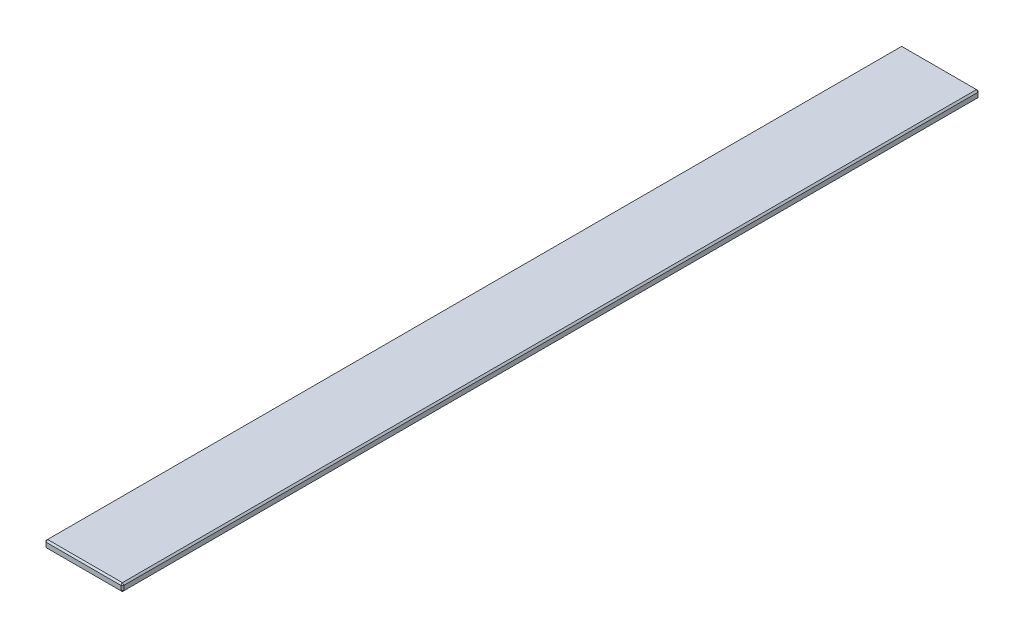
ISO-10303-21;
HEADER;
FILE_DESCRIPTION(('STEP AP214'),'2;1');
FILE_NAME('part.step','',(''),(''),'','','');
FILE_SCHEMA(('AUTOMOTIVE_DESIGN { 1 0 10303 214 1 1 1 1 }'));
ENDSEC;
DATA;
#1=APPLICATION_CONTEXT('core data for automotive mechanical design processes');
#2=APPLICATION_PROTOCOL_DEFINITION('international standard','automotive_design',2000,#1);
#3=PRODUCT_CONTEXT('',#1,'mechanical');
#4=PRODUCT('Part','Part','',(#3));
#5=PRODUCT_RELATED_PRODUCT_CATEGORY('part','',(#4));
#6=PRODUCT_DEFINITION_FORMATION('','',#4);
#7=PRODUCT_DEFINITION_CONTEXT('part definition',#1,'design');
#8=PRODUCT_DEFINITION('design','',#6,#7);
#9=PRODUCT_DEFINITION_SHAPE('','',#8);
#10=(LENGTH_UNIT() NAMED_UNIT(*) SI_UNIT(.MILLI.,.METRE.));
#11=(NAMED_UNIT(*) PLANE_ANGLE_UNIT() SI_UNIT($,.RADIAN.));
#12=(NAMED_UNIT(*) SI_UNIT($,.STERADIAN.) SOLID_ANGLE_UNIT());
#13=UNCERTAINTY_MEASURE_WITH_UNIT(LENGTH_MEASURE(1.E-05),#10,'distance_accuracy_value','');
#14=(GEOMETRIC_REPRESENTATION_CONTEXT(3) GLOBAL_UNCERTAINTY_ASSIGNED_CONTEXT((#13)) GLOBAL_UNIT_ASSIGNED_CONTEXT((#10,
#11,#12)) REPRESENTATION_CONTEXT('',''));
#15=CARTESIAN_POINT('',(0.,0.,0.));
#16=DIRECTION('',(0.,0.,1.));
#17=DIRECTION('',(1.,0.,0.));
#18=AXIS2_PLACEMENT_3D('',#15,#16,#17);
#19=CARTESIAN_POINT('',(50.,-4.99999999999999,550.));
#20=DIRECTION('',(-1.,0.,0.));
#21=DIRECTION('',(0.,0.,1.));
#22=AXIS2_PLACEMENT_3D('',#19,#20,#21);
#23=PLANE('',#22);
#24=DIRECTION('',(0.,0.,-1.));
#25=VECTOR('',#24,1.);
#26=CARTESIAN_POINT('',(50.,-2.99999999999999,550.));
#27=LINE('',#26,#25);
#28=CARTESIAN_POINT('',(50.,-2.99999999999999,548.));
#29=VERTEX_POINT('',#28);
#30=CARTESIAN_POINT('',(50.,-2.99999999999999,-548.));
#31=VERTEX_POINT('',#30);
#32=EDGE_CURVE('E173',#29,#31,#27,.T.);
#33=ORIENTED_EDGE('',*,*,#32,.T.);
#34=DIRECTION('',(0.,1.,0.));
#35=VECTOR('',#34,1.);
#36=CARTESIAN_POINT('',(50.,-4.99999999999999,-548.));
#37=LINE('',#36,#35);
#38=CARTESIAN_POINT('',(50.,2.9999999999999,-548.));
#39=VERTEX_POINT('',#38);
#40=EDGE_CURVE('E175',#31,#39,#37,.T.);
#41=ORIENTED_EDGE('',*,*,#40,.T.);
#42=DIRECTION('',(0.,0.,1.));
#43=VECTOR('',#42,1.);
#44=CARTESIAN_POINT('',(50.,2.9999999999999,550.));
#45=LINE('',#44,#43);
#46=CARTESIAN_POINT('',(50.,2.9999999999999,548.));
#47=VERTEX_POINT('',#46);
#48=EDGE_CURVE('E169',#39,#47,#45,.T.);
#49=ORIENTED_EDGE('',*,*,#48,.T.);
#50=DIRECTION('',(0.,-1.,0.));
#51=VECTOR('',#50,1.);
#52=CARTESIAN_POINT('',(50.,-4.99999999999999,548.));
#53=LINE('',#52,#51);
#54=EDGE_CURVE('E171',#47,#29,#53,.T.);
#55=ORIENTED_EDGE('',*,*,#54,.T.);
#56=EDGE_LOOP('',(#33,#41,#49,#55));
#57=FACE_BOUND('',#56,.T.);
#58=ADVANCED_FACE('F30',(#57),#23,.F.);
#59=CARTESIAN_POINT('',(50.,5.00000000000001,550.));
#60=DIRECTION('',(0.,-1.,0.));
#61=DIRECTION('',(1.,0.,0.));
#62=AXIS2_PLACEMENT_3D('',#59,#60,#61);
#63=PLANE('',#62);
#64=DIRECTION('',(1.,0.,0.));
#65=VECTOR('',#64,1.);
#66=CARTESIAN_POINT('',(50.,5.00000000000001,548.));
#67=LINE('',#66,#65);
#68=CARTESIAN_POINT('',(-48.,4.99999999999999,548.));
#69=VERTEX_POINT('',#68);
#70=CARTESIAN_POINT('',(48.,5.00000000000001,548.));
#71=VERTEX_POINT('',#70);
#72=EDGE_CURVE('E39',#69,#71,#67,.T.);
#73=ORIENTED_EDGE('',*,*,#72,.T.);
#74=DIRECTION('',(0.,0.,-1.));
#75=VECTOR('',#74,1.);
#76=CARTESIAN_POINT('',(48.,5.00000000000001,550.));
#77=LINE('',#76,#75);
#78=CARTESIAN_POINT('',(48.,5.00000000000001,-548.));
#79=VERTEX_POINT('',#78);
#80=EDGE_CURVE('E11',#71,#79,#77,.T.);
#81=ORIENTED_EDGE('',*,*,#80,.T.);
#82=DIRECTION('',(-1.,0.,0.));
#83=VECTOR('',#82,1.);
#84=CARTESIAN_POINT('',(50.,5.00000000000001,-548.));
#85=LINE('',#84,#83);
#86=CARTESIAN_POINT('',(-48.,4.99999999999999,-548.));
#87=VERTEX_POINT('',#86);
#88=EDGE_CURVE('E195',#79,#87,#85,.T.);
#89=ORIENTED_EDGE('',*,*,#88,.T.);
#90=DIRECTION('',(0.,0.,1.));
#91=VECTOR('',#90,1.);
#92=CARTESIAN_POINT('',(-48.,4.99999999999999,550.));
#93=LINE('',#92,#91);
#94=EDGE_CURVE('E50',#87,#69,#93,.T.);
#95=ORIENTED_EDGE('',*,*,#94,.T.);
#96=EDGE_LOOP('',(#73,#81,#89,#95));
#97=FACE_BOUND('',#96,.T.);
#98=ADVANCED_FACE('F307',(#97),#63,.F.);
#99=CARTESIAN_POINT('',(-50.,-5.00000000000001,550.));
#100=DIRECTION('',(1.,0.,0.));
#101=DIRECTION('',(0.,0.,-1.));
#102=AXIS2_PLACEMENT_3D('',#99,#100,#101);
#103=PLANE('',#102);
#104=DIRECTION('',(0.,0.,-1.));
#105=VECTOR('',#104,1.);
#106=CARTESIAN_POINT('',(-50.,2.99999999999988,550.));
#107=LINE('',#106,#105);
#108=CARTESIAN_POINT('',(-50.,2.99999999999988,548.));
#109=VERTEX_POINT('',#108);
#110=CARTESIAN_POINT('',(-50.,2.99999999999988,-548.));
#111=VERTEX_POINT('',#110);
#112=EDGE_CURVE('E122',#109,#111,#107,.T.);
#113=ORIENTED_EDGE('',*,*,#112,.T.);
#114=DIRECTION('',(0.,-1.,0.));
#115=VECTOR('',#114,1.);
#116=CARTESIAN_POINT('',(-50.,-5.00000000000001,-548.));
#117=LINE('',#116,#115);
#118=CARTESIAN_POINT('',(-50.,-2.99999999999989,-548.));
#119=VERTEX_POINT('',#118);
#120=EDGE_CURVE('E158',#111,#119,#117,.T.);
#121=ORIENTED_EDGE('',*,*,#120,.T.);
#122=DIRECTION('',(0.,0.,1.));
#123=VECTOR('',#122,1.);
#124=CARTESIAN_POINT('',(-50.,-2.99999999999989,550.));
#125=LINE('',#124,#123);
#126=CARTESIAN_POINT('',(-50.,-2.99999999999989,548.));
#127=VERTEX_POINT('',#126);
#128=EDGE_CURVE('E125',#119,#127,#125,.T.);
#129=ORIENTED_EDGE('',*,*,#128,.T.);
#130=DIRECTION('',(0.,1.,0.));
#131=VECTOR('',#130,1.);
#132=CARTESIAN_POINT('',(-50.,4.99999999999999,548.));
#133=LINE('',#132,#131);
#134=EDGE_CURVE('E117',#127,#109,#133,.T.);
#135=ORIENTED_EDGE('',*,*,#134,.T.);
#136=EDGE_LOOP('',(#113,#121,#129,#135));
#137=FACE_BOUND('',#136,.T.);
#138=ADVANCED_FACE('F119',(#137),#103,.F.);
#139=CARTESIAN_POINT('',(50.,-4.99999999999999,550.));
#140=DIRECTION('',(0.,1.,0.));
#141=DIRECTION('',(-1.,0.,0.));
#142=AXIS2_PLACEMENT_3D('',#139,#140,#141);
#143=PLANE('',#142);
#144=DIRECTION('',(-1.,0.,0.));
#145=VECTOR('',#144,1.);
#146=CARTESIAN_POINT('',(-50.,-5.00000000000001,548.));
#147=LINE('',#146,#145);
#148=CARTESIAN_POINT('',(47.9999999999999,-4.99999999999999,548.));
#149=VERTEX_POINT('',#148);
#150=CARTESIAN_POINT('',(-48.,-5.00000000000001,548.));
#151=VERTEX_POINT('',#150);
#152=EDGE_CURVE('E178',#149,#151,#147,.T.);
#153=ORIENTED_EDGE('',*,*,#152,.T.);
#154=DIRECTION('',(0.,0.,-1.));
#155=VECTOR('',#154,1.);
#156=CARTESIAN_POINT('',(-48.,-5.00000000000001,550.));
#157=LINE('',#156,#155);
#158=CARTESIAN_POINT('',(-48.,-5.00000000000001,-548.));
#159=VERTEX_POINT('',#158);
#160=EDGE_CURVE('E184',#151,#159,#157,.T.);
#161=ORIENTED_EDGE('',*,*,#160,.T.);
#162=DIRECTION('',(1.,0.,0.));
#163=VECTOR('',#162,1.);
#164=CARTESIAN_POINT('',(50.,-4.99999999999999,-548.));
#165=LINE('',#164,#163);
#166=CARTESIAN_POINT('',(47.9999999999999,-4.99999999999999,-548.));
#167=VERTEX_POINT('',#166);
#168=EDGE_CURVE('E182',#159,#167,#165,.T.);
#169=ORIENTED_EDGE('',*,*,#168,.T.);
#170=DIRECTION('',(0.,0.,1.));
#171=VECTOR('',#170,1.);
#172=CARTESIAN_POINT('',(47.9999999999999,-4.99999999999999,550.));
#173=LINE('',#172,#171);
#174=EDGE_CURVE('E180',#167,#149,#173,.T.);
#175=ORIENTED_EDGE('',*,*,#174,.T.);
#176=EDGE_LOOP('',(#153,#161,#169,#175));
#177=FACE_BOUND('',#176,.T.);
#178=ADVANCED_FACE('F272',(#177),#143,.F.);
#179=CARTESIAN_POINT('',(50.,5.00000000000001,550.));
#180=DIRECTION('',(0.,0.,1.));
#181=DIRECTION('',(1.,0.,0.));
#182=AXIS2_PLACEMENT_3D('',#179,#180,#181);
#183=PLANE('',#182);
#184=DIRECTION('',(0.,-1.,0.));
#185=VECTOR('',#184,1.);
#186=CARTESIAN_POINT('',(-48.,-5.00000000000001,550.));
#187=LINE('',#186,#185);
#188=CARTESIAN_POINT('',(-48.,2.99999999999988,550.));
#189=VERTEX_POINT('',#188);
#190=CARTESIAN_POINT('',(-48.,-3.,550.));
#191=VERTEX_POINT('',#190);
#192=EDGE_CURVE('E135',#189,#191,#187,.T.);
#193=ORIENTED_EDGE('',*,*,#192,.T.);
#194=DIRECTION('',(1.,0.,0.));
#195=VECTOR('',#194,1.);
#196=CARTESIAN_POINT('',(50.,-2.99999999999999,550.));
#197=LINE('',#196,#195);
#198=CARTESIAN_POINT('',(48.,-2.99999999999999,550.));
#199=VERTEX_POINT('',#198);
#200=EDGE_CURVE('E192',#191,#199,#197,.T.);
#201=ORIENTED_EDGE('',*,*,#200,.T.);
#202=DIRECTION('',(0.,1.,0.));
#203=VECTOR('',#202,1.);
#204=CARTESIAN_POINT('',(48.,5.00000000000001,550.));
#205=LINE('',#204,#203);
#206=CARTESIAN_POINT('',(48.,2.99999999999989,550.));
#207=VERTEX_POINT('',#206);
#208=EDGE_CURVE('E189',#199,#207,#205,.T.);
#209=ORIENTED_EDGE('',*,*,#208,.T.);
#210=DIRECTION('',(-1.,0.,0.));
#211=VECTOR('',#210,1.);
#212=CARTESIAN_POINT('',(-50.,2.99999999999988,550.));
#213=LINE('',#212,#211);
#214=EDGE_CURVE('E187',#207,#189,#213,.T.);
#215=ORIENTED_EDGE('',*,*,#214,.T.);
#216=EDGE_LOOP('',(#193,#201,#209,#215));
#217=FACE_BOUND('',#216,.T.);
#218=ADVANCED_FACE('F259',(#217),#183,.T.);
#219=CARTESIAN_POINT('',(50.,5.00000000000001,-550.));
#220=DIRECTION('',(0.,0.,1.));
#221=DIRECTION('',(1.,0.,0.));
#222=AXIS2_PLACEMENT_3D('',#219,#220,#221);
#223=PLANE('',#222);
#224=DIRECTION('',(0.,-1.,0.));
#225=VECTOR('',#224,1.);
#226=CARTESIAN_POINT('',(47.9999999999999,5.00000000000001,-550.));
#227=LINE('',#226,#225);
#228=CARTESIAN_POINT('',(47.9999999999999,2.99999999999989,-550.));
#229=VERTEX_POINT('',#228);
#230=CARTESIAN_POINT('',(47.9999999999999,-2.99999999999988,-550.));
#231=VERTEX_POINT('',#230);
#232=EDGE_CURVE('E162',#229,#231,#227,.T.);
#233=ORIENTED_EDGE('',*,*,#232,.T.);
#234=DIRECTION('',(-1.,0.,0.));
#235=VECTOR('',#234,1.);
#236=CARTESIAN_POINT('',(50.,-2.99999999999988,-550.));
#237=LINE('',#236,#235);
#238=CARTESIAN_POINT('',(-47.9999999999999,-2.99999999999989,-550.));
#239=VERTEX_POINT('',#238);
#240=EDGE_CURVE('E167',#231,#239,#237,.T.);
#241=ORIENTED_EDGE('',*,*,#240,.T.);
#242=DIRECTION('',(0.,1.,0.));
#243=VECTOR('',#242,1.);
#244=CARTESIAN_POINT('',(-47.9999999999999,5.00000000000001,-550.));
#245=LINE('',#244,#243);
#246=CARTESIAN_POINT('',(-47.9999999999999,2.99999999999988,-550.));
#247=VERTEX_POINT('',#246);
#248=EDGE_CURVE('E164',#239,#247,#245,.T.);
#249=ORIENTED_EDGE('',*,*,#248,.T.);
#250=DIRECTION('',(1.,0.,0.));
#251=VECTOR('',#250,1.);
#252=CARTESIAN_POINT('',(50.,2.99999999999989,-550.));
#253=LINE('',#252,#251);
#254=EDGE_CURVE('E160',#247,#229,#253,.T.);
#255=ORIENTED_EDGE('',*,*,#254,.T.);
#256=EDGE_LOOP('',(#233,#241,#249,#255));
#257=FACE_BOUND('',#256,.T.);
#258=ADVANCED_FACE('F473',(#257),#223,.F.);
#259=CARTESIAN_POINT('',(48.,5.00000000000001,550.));
#260=DIRECTION('',(0.707106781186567,0.,0.707106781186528));
#261=DIRECTION('',(0.707106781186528,0.,-0.707106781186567));
#262=AXIS2_PLACEMENT_3D('',#259,#260,#261);
#263=PLANE('',#262);
#264=DIRECTION('',(0.707106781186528,0.,-0.707106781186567));
#265=VECTOR('',#264,1.);
#266=CARTESIAN_POINT('',(48.,2.99999999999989,550.));
#267=LINE('',#266,#265);
#268=EDGE_CURVE('E34',#207,#47,#267,.T.);
#269=ORIENTED_EDGE('',*,*,#268,.F.);
#270=ORIENTED_EDGE('',*,*,#208,.F.);
#271=DIRECTION('',(-0.707106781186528,0.,0.707106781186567));
#272=VECTOR('',#271,1.);
#273=CARTESIAN_POINT('',(49.,-2.99999999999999,549.));
#274=LINE('',#273,#272);
#275=EDGE_CURVE('E155',#29,#199,#274,.T.);
#276=ORIENTED_EDGE('',*,*,#275,.F.);
#277=ORIENTED_EDGE('',*,*,#54,.F.);
#278=EDGE_LOOP('',(#269,#270,#276,#277));
#279=FACE_BOUND('',#278,.T.);
#280=ADVANCED_FACE('F32',(#279),#263,.T.);
#281=CARTESIAN_POINT('',(48.,2.99999999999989,550.));
#282=DIRECTION('',(0.577350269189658,0.577350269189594,0.577350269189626));
#283=DIRECTION('',(0.707106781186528,0.,-0.707106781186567));
#284=AXIS2_PLACEMENT_3D('',#281,#282,#283);
#285=PLANE('',#284);
#286=DIRECTION('',(0.,-0.707106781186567,0.707106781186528));
#287=VECTOR('',#286,1.);
#288=CARTESIAN_POINT('',(48.,2.99999999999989,550.));
#289=LINE('',#288,#287);
#290=EDGE_CURVE('E240',#207,#71,#289,.F.);
#291=ORIENTED_EDGE('',*,*,#290,.F.);
#292=ORIENTED_EDGE('',*,*,#268,.T.);
#293=DIRECTION('',(0.707106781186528,-0.707106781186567,0.));
#294=VECTOR('',#293,1.);
#295=CARTESIAN_POINT('',(49.,3.99999999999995,548.));
#296=LINE('',#295,#294);
#297=EDGE_CURVE('E242',#71,#47,#296,.T.);
#298=ORIENTED_EDGE('',*,*,#297,.F.);
#299=EDGE_LOOP('',(#291,#292,#298));
#300=FACE_BOUND('',#299,.T.);
#301=ADVANCED_FACE('F294',(#300),#285,.T.);
#302=CARTESIAN_POINT('',(47.9999999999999,-4.99999999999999,548.));
#303=DIRECTION('',(0.577350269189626,-0.577350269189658,0.577350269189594));
#304=DIRECTION('',(0.707106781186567,0.707106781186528,0.));
#305=AXIS2_PLACEMENT_3D('',#302,#303,#304);
#306=PLANE('',#305);
#307=DIRECTION('',(-0.707106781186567,-0.707106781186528,0.));
#308=VECTOR('',#307,1.);
#309=CARTESIAN_POINT('',(47.9999999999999,-4.99999999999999,548.));
#310=LINE('',#309,#308);
#311=EDGE_CURVE('E235',#29,#149,#310,.T.);
#312=ORIENTED_EDGE('',*,*,#311,.F.);
#313=ORIENTED_EDGE('',*,*,#275,.T.);
#314=DIRECTION('',(0.,-0.707106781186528,-0.707106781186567));
#315=VECTOR('',#314,1.);
#316=CARTESIAN_POINT('',(47.9999999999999,-4.99999999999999,548.));
#317=LINE('',#316,#315);
#318=EDGE_CURVE('E238',#149,#199,#317,.F.);
#319=ORIENTED_EDGE('',*,*,#318,.F.);
#320=EDGE_LOOP('',(#312,#313,#319));
#321=FACE_BOUND('',#320,.T.);
#322=ADVANCED_FACE('F250',(#321),#306,.T.);
#323=CARTESIAN_POINT('',(48.,5.00000000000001,550.));
#324=DIRECTION('',(-0.707106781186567,-0.707106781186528,0.));
#325=DIRECTION('',(0.707106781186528,-0.707106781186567,0.));
#326=AXIS2_PLACEMENT_3D('',#323,#324,#325);
#327=PLANE('',#326);
#328=ORIENTED_EDGE('',*,*,#297,.T.);
#329=ORIENTED_EDGE('',*,*,#48,.F.);
#330=DIRECTION('',(-0.707106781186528,0.707106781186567,0.));
#331=VECTOR('',#330,1.);
#332=CARTESIAN_POINT('',(50.,2.9999999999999,-548.));
#333=LINE('',#332,#331);
#334=EDGE_CURVE('E230',#79,#39,#333,.F.);
#335=ORIENTED_EDGE('',*,*,#334,.F.);
#336=ORIENTED_EDGE('',*,*,#80,.F.);
#337=EDGE_LOOP('',(#328,#329,#335,#336));
#338=FACE_BOUND('',#337,.T.);
#339=ADVANCED_FACE('F290',(#338),#327,.F.);
#340=CARTESIAN_POINT('',(50.,2.9999999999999,550.));
#341=DIRECTION('',(0.,0.707106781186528,0.707106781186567));
#342=DIRECTION('',(0.,-0.707106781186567,0.707106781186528));
#343=AXIS2_PLACEMENT_3D('',#340,#341,#342);
#344=PLANE('',#343);
#345=ORIENTED_EDGE('',*,*,#290,.T.);
#346=ORIENTED_EDGE('',*,*,#72,.F.);
#347=DIRECTION('',(0.,0.707106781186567,-0.707106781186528));
#348=VECTOR('',#347,1.);
#349=CARTESIAN_POINT('',(-48.,3.99999999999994,549.));
#350=LINE('',#349,#348);
#351=EDGE_CURVE('E139',#189,#69,#350,.T.);
#352=ORIENTED_EDGE('',*,*,#351,.F.);
#353=ORIENTED_EDGE('',*,*,#214,.F.);
#354=EDGE_LOOP('',(#345,#346,#352,#353));
#355=FACE_BOUND('',#354,.T.);
#356=ADVANCED_FACE('F297',(#355),#344,.T.);
#357=CARTESIAN_POINT('',(-48.,5.00000000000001,550.));
#358=DIRECTION('',(-0.707106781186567,0.,0.707106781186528));
#359=DIRECTION('',(0.707106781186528,0.,0.707106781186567));
#360=AXIS2_PLACEMENT_3D('',#357,#358,#359);
#361=PLANE('',#360);
#362=DIRECTION('',(-0.707106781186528,0.,-0.707106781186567));
#363=VECTOR('',#362,1.);
#364=CARTESIAN_POINT('',(-50.,-2.99999999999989,548.));
#365=LINE('',#364,#363);
#366=EDGE_CURVE('E140',#191,#127,#365,.T.);
#367=ORIENTED_EDGE('',*,*,#366,.F.);
#368=ORIENTED_EDGE('',*,*,#192,.F.);
#369=DIRECTION('',(0.707106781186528,0.,0.707106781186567));
#370=VECTOR('',#369,1.);
#371=CARTESIAN_POINT('',(-50.,2.99999999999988,548.));
#372=LINE('',#371,#370);
#373=EDGE_CURVE('E132',#109,#189,#372,.T.);
#374=ORIENTED_EDGE('',*,*,#373,.F.);
#375=ORIENTED_EDGE('',*,*,#134,.F.);
#376=EDGE_LOOP('',(#367,#368,#374,#375));
#377=FACE_BOUND('',#376,.T.);
#378=ADVANCED_FACE('F134',(#377),#361,.T.);
#379=CARTESIAN_POINT('',(50.,-2.99999999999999,550.));
#380=DIRECTION('',(0.,-0.707106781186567,0.707106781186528));
#381=DIRECTION('',(0.,-0.707106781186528,-0.707106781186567));
#382=AXIS2_PLACEMENT_3D('',#379,#380,#381);
#383=PLANE('',#382);
#384=ORIENTED_EDGE('',*,*,#318,.T.);
#385=ORIENTED_EDGE('',*,*,#200,.F.);
#386=DIRECTION('',(0.,0.707106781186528,0.707106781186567));
#387=VECTOR('',#386,1.);
#388=CARTESIAN_POINT('',(-48.,-4.00000000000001,549.));
#389=LINE('',#388,#387);
#390=EDGE_CURVE('E225',#151,#191,#389,.T.);
#391=ORIENTED_EDGE('',*,*,#390,.F.);
#392=ORIENTED_EDGE('',*,*,#152,.F.);
#393=EDGE_LOOP('',(#384,#385,#391,#392));
#394=FACE_BOUND('',#393,.T.);
#395=ADVANCED_FACE('F262',(#394),#383,.T.);
#396=CARTESIAN_POINT('',(50.,-2.99999999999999,550.));
#397=DIRECTION('',(-0.707106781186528,0.707106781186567,0.));
#398=DIRECTION('',(-0.707106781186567,-0.707106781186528,0.));
#399=AXIS2_PLACEMENT_3D('',#396,#397,#398);
#400=PLANE('',#399);
#401=ORIENTED_EDGE('',*,*,#311,.T.);
#402=ORIENTED_EDGE('',*,*,#174,.F.);
#403=DIRECTION('',(0.707106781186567,0.707106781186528,0.));
#404=VECTOR('',#403,1.);
#405=CARTESIAN_POINT('',(48.9999999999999,-3.99999999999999,-548.));
#406=LINE('',#405,#404);
#407=EDGE_CURVE('E222',#31,#167,#406,.F.);
#408=ORIENTED_EDGE('',*,*,#407,.F.);
#409=ORIENTED_EDGE('',*,*,#32,.F.);
#410=EDGE_LOOP('',(#401,#402,#408,#409));
#411=FACE_BOUND('',#410,.T.);
#412=ADVANCED_FACE('F276',(#411),#400,.F.);
#413=CARTESIAN_POINT('',(50.,-4.99999999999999,-548.));
#414=DIRECTION('',(-0.707106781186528,0.,0.707106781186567));
#415=DIRECTION('',(0.707106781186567,0.,0.707106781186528));
#416=AXIS2_PLACEMENT_3D('',#413,#414,#415);
#417=PLANE('',#416);
#418=DIRECTION('',(0.707106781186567,0.,0.707106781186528));
#419=VECTOR('',#418,1.);
#420=CARTESIAN_POINT('',(50.,2.9999999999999,-548.));
#421=LINE('',#420,#419);
#422=EDGE_CURVE('E232',#39,#229,#421,.F.);
#423=ORIENTED_EDGE('',*,*,#422,.F.);
#424=ORIENTED_EDGE('',*,*,#40,.F.);
#425=DIRECTION('',(-0.707106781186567,0.,-0.707106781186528));
#426=VECTOR('',#425,1.);
#427=CARTESIAN_POINT('',(47.9999999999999,-2.99999999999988,-550.));
#428=LINE('',#427,#426);
#429=EDGE_CURVE('E219',#231,#31,#428,.F.);
#430=ORIENTED_EDGE('',*,*,#429,.F.);
#431=ORIENTED_EDGE('',*,*,#232,.F.);
#432=EDGE_LOOP('',(#423,#424,#430,#431));
#433=FACE_BOUND('',#432,.T.);
#434=ADVANCED_FACE('F282',(#433),#417,.F.);
#435=CARTESIAN_POINT('',(50.,2.9999999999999,-548.));
#436=DIRECTION('',(0.577350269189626,0.577350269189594,-0.577350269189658));
#437=DIRECTION('',(-0.707106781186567,0.,-0.707106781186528));
#438=AXIS2_PLACEMENT_3D('',#435,#436,#437);
#439=PLANE('',#438);
#440=ORIENTED_EDGE('',*,*,#334,.T.);
#441=ORIENTED_EDGE('',*,*,#422,.T.);
#442=DIRECTION('',(0.,-0.707106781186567,-0.707106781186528));
#443=VECTOR('',#442,1.);
#444=CARTESIAN_POINT('',(47.9999999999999,3.99999999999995,-549.));
#445=LINE('',#444,#443);
#446=EDGE_CURVE('E146',#79,#229,#445,.T.);
#447=ORIENTED_EDGE('',*,*,#446,.F.);
#448=EDGE_LOOP('',(#440,#441,#447));
#449=FACE_BOUND('',#448,.T.);
#450=ADVANCED_FACE('F347',(#449),#439,.T.);
#451=CARTESIAN_POINT('',(-50.,2.99999999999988,548.));
#452=DIRECTION('',(-0.577350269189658,0.577350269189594,0.577350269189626));
#453=DIRECTION('',(0.707106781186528,0.,0.707106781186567));
#454=AXIS2_PLACEMENT_3D('',#451,#452,#453);
#455=PLANE('',#454);
#456=ORIENTED_EDGE('',*,*,#373,.T.);
#457=ORIENTED_EDGE('',*,*,#351,.T.);
#458=DIRECTION('',(0.707106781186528,0.707106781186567,0.));
#459=VECTOR('',#458,1.);
#460=CARTESIAN_POINT('',(-50.,2.99999999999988,548.));
#461=LINE('',#460,#459);
#462=EDGE_CURVE('E143',#109,#69,#461,.T.);
#463=ORIENTED_EDGE('',*,*,#462,.F.);
#464=EDGE_LOOP('',(#456,#457,#463));
#465=FACE_BOUND('',#464,.T.);
#466=ADVANCED_FACE('F144',(#465),#455,.T.);
#467=CARTESIAN_POINT('',(-50.,-2.99999999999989,548.));
#468=DIRECTION('',(-0.577350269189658,-0.577350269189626,0.577350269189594));
#469=DIRECTION('',(0.707106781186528,-0.707106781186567,0.));
#470=AXIS2_PLACEMENT_3D('',#467,#468,#469);
#471=PLANE('',#470);
#472=ORIENTED_EDGE('',*,*,#390,.T.);
#473=ORIENTED_EDGE('',*,*,#366,.T.);
#474=DIRECTION('',(-0.707106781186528,0.707106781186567,0.));
#475=VECTOR('',#474,1.);
#476=CARTESIAN_POINT('',(-50.,-2.99999999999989,548.));
#477=LINE('',#476,#475);
#478=EDGE_CURVE('E147',#151,#127,#477,.T.);
#479=ORIENTED_EDGE('',*,*,#478,.F.);
#480=EDGE_LOOP('',(#472,#473,#479));
#481=FACE_BOUND('',#480,.T.);
#482=ADVANCED_FACE('F265',(#481),#471,.T.);
#483=CARTESIAN_POINT('',(47.9999999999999,-2.99999999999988,-550.));
#484=DIRECTION('',(0.577350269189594,-0.577350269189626,-0.577350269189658));
#485=DIRECTION('',(0.,0.707106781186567,-0.707106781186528));
#486=AXIS2_PLACEMENT_3D('',#483,#484,#485);
#487=PLANE('',#486);
#488=ORIENTED_EDGE('',*,*,#429,.T.);
#489=ORIENTED_EDGE('',*,*,#407,.T.);
#490=DIRECTION('',(0.,-0.707106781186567,0.707106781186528));
#491=VECTOR('',#490,1.);
#492=CARTESIAN_POINT('',(47.9999999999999,-2.99999999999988,-550.));
#493=LINE('',#492,#491);
#494=EDGE_CURVE('E212',#231,#167,#493,.T.);
#495=ORIENTED_EDGE('',*,*,#494,.F.);
#496=EDGE_LOOP('',(#488,#489,#495));
#497=FACE_BOUND('',#496,.T.);
#498=ADVANCED_FACE('F338',(#497),#487,.T.);
#499=CARTESIAN_POINT('',(50.,5.00000000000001,-548.));
#500=DIRECTION('',(0.,-0.707106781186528,0.707106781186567));
#501=DIRECTION('',(0.,-0.707106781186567,-0.707106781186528));
#502=AXIS2_PLACEMENT_3D('',#499,#500,#501);
#503=PLANE('',#502);
#504=ORIENTED_EDGE('',*,*,#446,.T.);
#505=ORIENTED_EDGE('',*,*,#254,.F.);
#506=DIRECTION('',(0.,0.707106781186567,0.707106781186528));
#507=VECTOR('',#506,1.);
#508=CARTESIAN_POINT('',(-47.9999999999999,2.99999999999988,-550.));
#509=LINE('',#508,#507);
#510=EDGE_CURVE('E209',#87,#247,#509,.F.);
#511=ORIENTED_EDGE('',*,*,#510,.F.);
#512=ORIENTED_EDGE('',*,*,#88,.F.);
#513=EDGE_LOOP('',(#504,#505,#511,#512));
#514=FACE_BOUND('',#513,.T.);
#515=ADVANCED_FACE('F335',(#514),#503,.F.);
#516=CARTESIAN_POINT('',(-50.,2.99999999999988,550.));
#517=DIRECTION('',(0.707106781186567,-0.707106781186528,0.));
#518=DIRECTION('',(0.707106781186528,0.707106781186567,0.));
#519=AXIS2_PLACEMENT_3D('',#516,#517,#518);
#520=PLANE('',#519);
#521=ORIENTED_EDGE('',*,*,#462,.T.);
#522=ORIENTED_EDGE('',*,*,#94,.F.);
#523=DIRECTION('',(-0.707106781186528,-0.707106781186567,0.));
#524=VECTOR('',#523,1.);
#525=CARTESIAN_POINT('',(-49.,3.99999999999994,-548.));
#526=LINE('',#525,#524);
#527=EDGE_CURVE('E151',#111,#87,#526,.F.);
#528=ORIENTED_EDGE('',*,*,#527,.F.);
#529=ORIENTED_EDGE('',*,*,#112,.F.);
#530=EDGE_LOOP('',(#521,#522,#528,#529));
#531=FACE_BOUND('',#530,.T.);
#532=ADVANCED_FACE('F149',(#531),#520,.F.);
#533=CARTESIAN_POINT('',(-48.,-5.00000000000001,550.));
#534=DIRECTION('',(0.707106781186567,0.707106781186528,0.));
#535=DIRECTION('',(-0.707106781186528,0.707106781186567,0.));
#536=AXIS2_PLACEMENT_3D('',#533,#534,#535);
#537=PLANE('',#536);
#538=ORIENTED_EDGE('',*,*,#478,.T.);
#539=ORIENTED_EDGE('',*,*,#128,.F.);
#540=DIRECTION('',(0.707106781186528,-0.707106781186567,0.));
#541=VECTOR('',#540,1.);
#542=CARTESIAN_POINT('',(-50.,-2.99999999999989,-548.));
#543=LINE('',#542,#541);
#544=EDGE_CURVE('E205',#159,#119,#543,.F.);
#545=ORIENTED_EDGE('',*,*,#544,.F.);
#546=ORIENTED_EDGE('',*,*,#160,.F.);
#547=EDGE_LOOP('',(#538,#539,#545,#546));
#548=FACE_BOUND('',#547,.T.);
#549=ADVANCED_FACE('F269',(#548),#537,.F.);
#550=CARTESIAN_POINT('',(50.,-4.99999999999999,-548.));
#551=DIRECTION('',(0.,0.707106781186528,0.707106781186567));
#552=DIRECTION('',(0.,-0.707106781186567,0.707106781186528));
#553=AXIS2_PLACEMENT_3D('',#550,#551,#552);
#554=PLANE('',#553);
#555=ORIENTED_EDGE('',*,*,#494,.T.);
#556=ORIENTED_EDGE('',*,*,#168,.F.);
#557=DIRECTION('',(0.,0.707106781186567,-0.707106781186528));
#558=VECTOR('',#557,1.);
#559=CARTESIAN_POINT('',(-47.9999999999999,-3.99999999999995,-549.));
#560=LINE('',#559,#558);
#561=EDGE_CURVE('E203',#239,#159,#560,.F.);
#562=ORIENTED_EDGE('',*,*,#561,.F.);
#563=ORIENTED_EDGE('',*,*,#240,.F.);
#564=EDGE_LOOP('',(#555,#556,#562,#563));
#565=FACE_BOUND('',#564,.T.);
#566=ADVANCED_FACE('F326',(#565),#554,.F.);
#567=CARTESIAN_POINT('',(-47.9999999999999,2.99999999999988,-550.));
#568=DIRECTION('',(-0.577350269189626,0.577350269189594,-0.577350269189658));
#569=DIRECTION('',(-0.707106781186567,0.,0.707106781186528));
#570=AXIS2_PLACEMENT_3D('',#567,#568,#569);
#571=PLANE('',#570);
#572=ORIENTED_EDGE('',*,*,#527,.T.);
#573=ORIENTED_EDGE('',*,*,#510,.T.);
#574=DIRECTION('',(0.707106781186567,0.,-0.707106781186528));
#575=VECTOR('',#574,1.);
#576=CARTESIAN_POINT('',(-47.9999999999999,2.99999999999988,-550.));
#577=LINE('',#576,#575);
#578=EDGE_CURVE('E201',#111,#247,#577,.T.);
#579=ORIENTED_EDGE('',*,*,#578,.F.);
#580=EDGE_LOOP('',(#572,#573,#579));
#581=FACE_BOUND('',#580,.T.);
#582=ADVANCED_FACE('F322',(#581),#571,.T.);
#583=CARTESIAN_POINT('',(-50.,-2.99999999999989,-548.));
#584=DIRECTION('',(-0.577350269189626,-0.577350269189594,-0.577350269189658));
#585=DIRECTION('',(-0.707106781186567,0.,0.707106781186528));
#586=AXIS2_PLACEMENT_3D('',#583,#584,#585);
#587=PLANE('',#586);
#588=ORIENTED_EDGE('',*,*,#561,.T.);
#589=ORIENTED_EDGE('',*,*,#544,.T.);
#590=DIRECTION('',(-0.707106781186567,0.,0.707106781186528));
#591=VECTOR('',#590,1.);
#592=CARTESIAN_POINT('',(-50.,-2.99999999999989,-548.));
#593=LINE('',#592,#591);
#594=EDGE_CURVE('E199',#239,#119,#593,.T.);
#595=ORIENTED_EDGE('',*,*,#594,.F.);
#596=EDGE_LOOP('',(#588,#589,#595));
#597=FACE_BOUND('',#596,.T.);
#598=ADVANCED_FACE('F318',(#597),#587,.T.);
#599=CARTESIAN_POINT('',(-50.,-5.00000000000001,-548.));
#600=DIRECTION('',(0.707106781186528,0.,0.707106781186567));
#601=DIRECTION('',(0.707106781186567,0.,-0.707106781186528));
#602=AXIS2_PLACEMENT_3D('',#599,#600,#601);
#603=PLANE('',#602);
#604=ORIENTED_EDGE('',*,*,#578,.T.);
#605=ORIENTED_EDGE('',*,*,#248,.F.);
#606=ORIENTED_EDGE('',*,*,#594,.T.);
#607=ORIENTED_EDGE('',*,*,#120,.F.);
#608=EDGE_LOOP('',(#604,#605,#606,#607));
#609=FACE_BOUND('',#608,.T.);
#610=ADVANCED_FACE('F315',(#609),#603,.F.);
#611=CLOSED_SHELL('',(#58,#98,#138,#178,#218,#258,#280,#301,#322,#339,#356,#378,#395,#412,#434,
#450,#466,#482,#498,#515,#532,#549,#566,#582,#598,#610));
#612=MANIFOLD_SOLID_BREP('B2',#611);
#613=ADVANCED_BREP_SHAPE_REPRESENTATION('',(#18,#612),#14);
#614=SHAPE_DEFINITION_REPRESENTATION(#9,#613);
ENDSEC;
END-ISO-10303-21;
